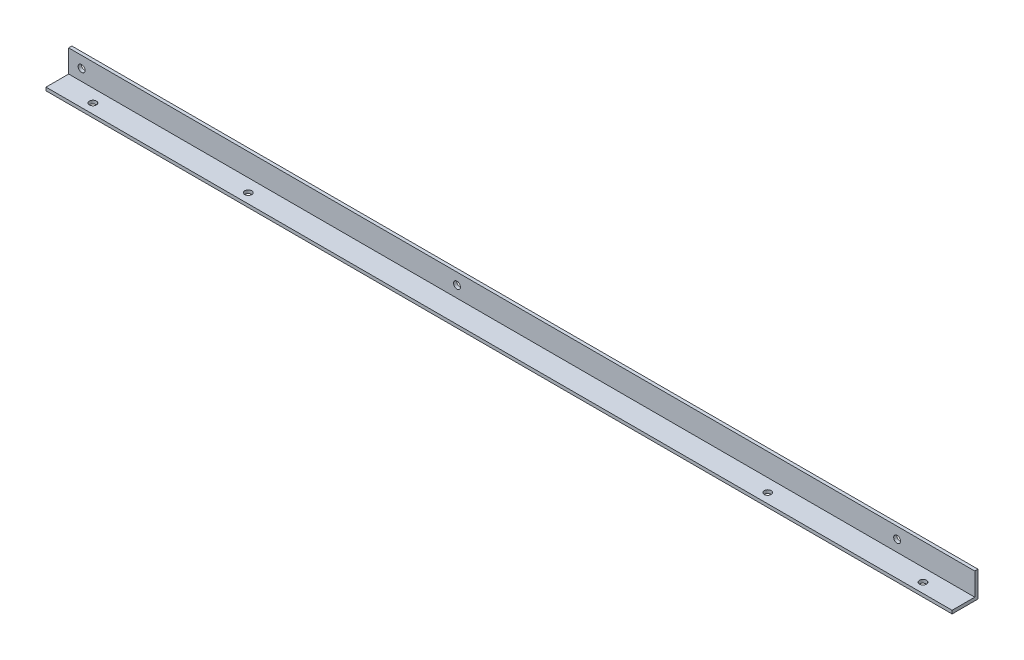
from build123d import *

# Parameters (mm, degrees)
SKETCH1_W           = 889
SKETCH1_H           = 25.4
BOSS_EXTRUDE1_DEPTH = 3.175
SKETCH2_W           = 889
SKETCH2_H           = 3.175
BOSS_EXTRUDE2_DEPTH = 22.225
SKETCH3_R           = 3.3782
CUT_EXTRUDE1_DEPTH  = 446.236443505
SKETCH4_R           = 3.3782
CUT_EXTRUDE2_DEPTH  = 446.779497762


with BuildPart() as part:
    # Sketch1 → Boss-Extrude1 (new body)
    with BuildSketch(Plane(origin=(0, 0, 0), x_dir=(1, 0, 0), z_dir=(0, 1, 0))):
        Rectangle(SKETCH1_W, SKETCH1_H)
    extrude(amount=BOSS_EXTRUDE1_DEPTH)

    # Sketch2 → Boss-Extrude2 (add)
    with BuildSketch(Plane(origin=(0, 3.175, 0), x_dir=(1, 0, 0), z_dir=(0, 1, 0))):
        with Locations((0, 11.1125)):
            Rectangle(SKETCH2_W, SKETCH2_H)
    extrude(amount=BOSS_EXTRUDE2_DEPTH)

    # Sketch3 → Cut-Extrude1 (cut, through all)
    with BuildSketch(Plane(origin=(0, 3.175, 0), x_dir=(1, 0, 0), z_dir=(0, 1, 0))):
        with Locations(Location((-407.9875, -3.175, 0), (0, 0, 270))):
            Circle(SKETCH3_R)
        with Locations(Location((-255.5875, -3.175, 0), (0, 0, 270))):
            Circle(SKETCH3_R)
        with Locations(Location((406.4, -3.175, 0), (0, 0, 270))):
            Circle(SKETCH3_R)
        with Locations(Location((254, -3.175, 0), (0, 0, 270))):
            Circle(SKETCH3_R)
    extrude(amount=-CUT_EXTRUDE1_DEPTH, mode=Mode.SUBTRACT)

    # Sketch4 → Cut-Extrude2 (cut, through all)
    with BuildSketch(Plane.XY.offset(-9.525)):
        with Locations((368.3, 14.2875)):
            Circle(SKETCH4_R)
        with Locations((-63.5, 14.2875)):
            Circle(SKETCH4_R)
        with Locations((-431.8, 14.2875)):
            Circle(SKETCH4_R)
    extrude(amount=-CUT_EXTRUDE2_DEPTH, mode=Mode.SUBTRACT)


solid = part.part
